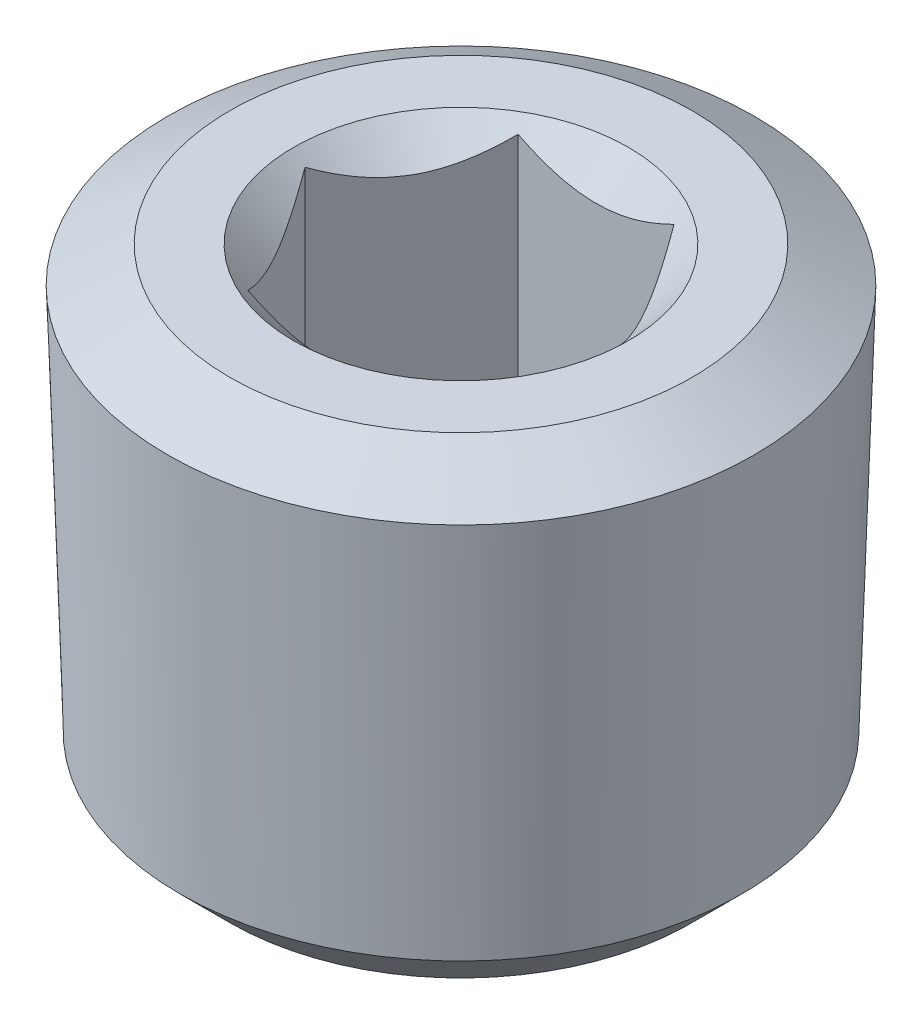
from build123d import *

# Parameters (mm, degrees)
CUT_EXTRUDE1_START = -5.588
CUT_EXTRUDE1_DEPTH = 5.317174


with BuildPart() as part:
    # Sketch2 → Revolve1 (revolve)
    with BuildSketch(Plane.XY, mode=Mode.PRIVATE) as revolve1_sk:
        Polygon((0, 0), (-5.432001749, 0), (-6.895130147, -0.844737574), (-6.611832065, -9.919969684), (-5.432001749, -11.0998), (0, -11.0998), align=None)
    revolve(revolve1_sk.sketch.rotate(Axis((0, 10.744282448, 0), (0, -1, 0)), 270), axis=Axis((0, 10.744282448, 0), (0, -1, 0)))

    # Sketch3 → Cut-Revolve1 (revolve, cut)
    with BuildSketch(Plane.XY, mode=Mode.PRIVATE) as cut_revolve1_sk:
        Polygon((0, 0), (-3.937, 0), (-3.175, -0.762), (-3.175, -5.588), (0, -7.495732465), align=None)
    revolve(cut_revolve1_sk.sketch.rotate(Axis((0, 2.934222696, 0), (0, -1, 0)), 270), axis=Axis((0, 2.934222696, 0), (0, -1, 0)), mode=Mode.SUBTRACT)

    # Sketch4 → Cut-Extrude1 (cut)
    with BuildSketch(Plane(origin=(0, 0, 0), x_dir=(1, 0, 0), z_dir=(0, 1, 0)).offset(CUT_EXTRUDE1_START)):
        Polygon((-1.833087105, -3.175), (1.833087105, -3.175), (3.666174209, 0), (1.833087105, 3.175), (-1.833087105, 3.175), (-3.666174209, 0), align=None)
    extrude(amount=CUT_EXTRUDE1_DEPTH, mode=Mode.SUBTRACT)


solid = part.part
